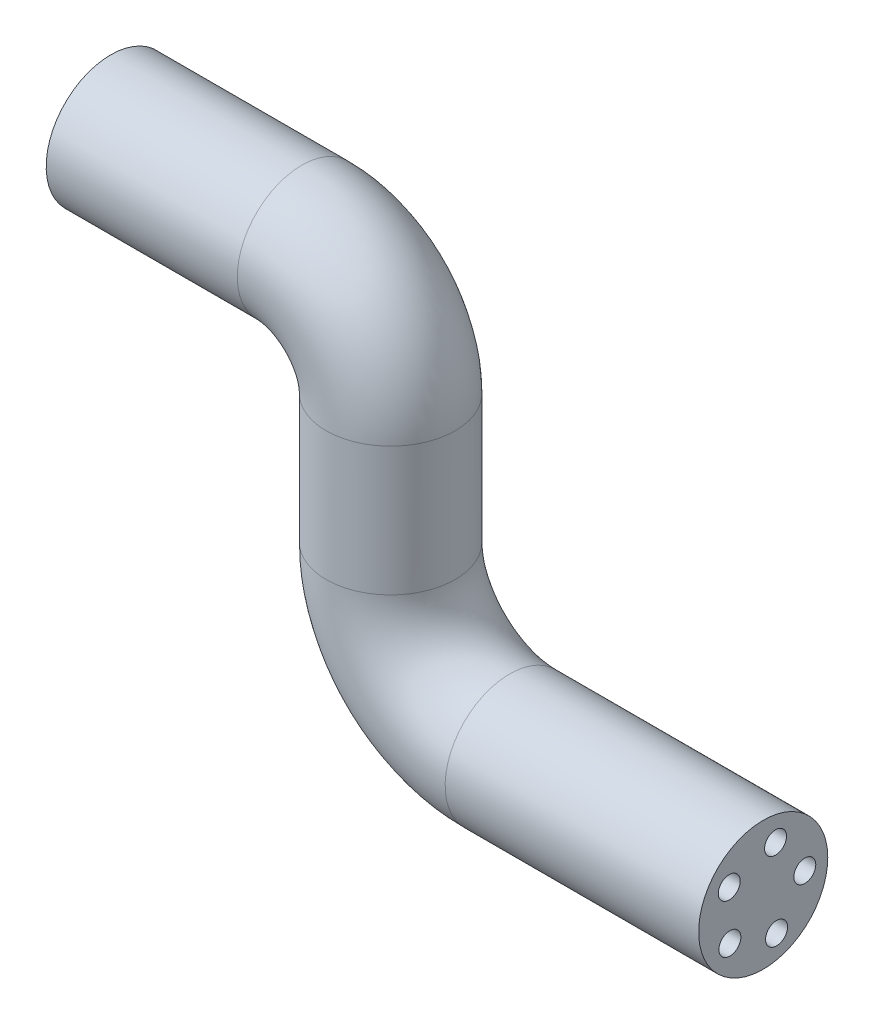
ISO-10303-21;
HEADER;
FILE_DESCRIPTION(('STEP AP214'),'2;1');
FILE_NAME('part.step','',(''),(''),'','','');
FILE_SCHEMA(('AUTOMOTIVE_DESIGN { 1 0 10303 214 1 1 1 1 }'));
ENDSEC;
DATA;
#1=APPLICATION_CONTEXT('core data for automotive mechanical design processes');
#2=APPLICATION_PROTOCOL_DEFINITION('international standard','automotive_design',2000,#1);
#3=PRODUCT_CONTEXT('',#1,'mechanical');
#4=PRODUCT('Part','Part','',(#3));
#5=PRODUCT_RELATED_PRODUCT_CATEGORY('part','',(#4));
#6=PRODUCT_DEFINITION_FORMATION('','',#4);
#7=PRODUCT_DEFINITION_CONTEXT('part definition',#1,'design');
#8=PRODUCT_DEFINITION('design','',#6,#7);
#9=PRODUCT_DEFINITION_SHAPE('','',#8);
#10=(LENGTH_UNIT() NAMED_UNIT(*) SI_UNIT(.MILLI.,.METRE.));
#11=(NAMED_UNIT(*) PLANE_ANGLE_UNIT() SI_UNIT($,.RADIAN.));
#12=(NAMED_UNIT(*) SI_UNIT($,.STERADIAN.) SOLID_ANGLE_UNIT());
#13=UNCERTAINTY_MEASURE_WITH_UNIT(LENGTH_MEASURE(1.E-05),#10,'distance_accuracy_value','');
#14=(GEOMETRIC_REPRESENTATION_CONTEXT(3) GLOBAL_UNCERTAINTY_ASSIGNED_CONTEXT((#13)) GLOBAL_UNIT_ASSIGNED_CONTEXT((#10,
#11,#12)) REPRESENTATION_CONTEXT('',''));
#15=CARTESIAN_POINT('',(0.,0.,0.));
#16=DIRECTION('',(0.,0.,1.));
#17=DIRECTION('',(1.,0.,0.));
#18=AXIS2_PLACEMENT_3D('',#15,#16,#17);
#19=CARTESIAN_POINT('',(80.2165233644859,0.219533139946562,0.));
#20=DIRECTION('',(-1.,0.,0.));
#21=DIRECTION('',(0.,0.,1.));
#22=AXIS2_PLACEMENT_3D('',#19,#20,#21);
#23=CYLINDRICAL_SURFACE('',#22,27.0969024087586);
#24=CARTESIAN_POINT('',(80.2165233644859,0.219533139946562,0.));
#25=DIRECTION('',(1.,0.,0.));
#26=DIRECTION('',(0.,0.,-1.));
#27=AXIS2_PLACEMENT_3D('',#24,#25,#26);
#28=CIRCLE('',#27,27.0969024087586);
#29=CARTESIAN_POINT('',(80.2165233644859,27.3164355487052,0.));
#30=VERTEX_POINT('',#29);
#31=EDGE_CURVE('E56',#30,#30,#28,.T.);
#32=ORIENTED_EDGE('',*,*,#31,.F.);
#33=EDGE_LOOP('',(#32));
#34=FACE_BOUND('',#33,.T.);
#35=CARTESIAN_POINT('',(0.,0.219533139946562,0.));
#36=DIRECTION('',(1.,0.,0.));
#37=DIRECTION('',(0.,0.,-1.));
#38=AXIS2_PLACEMENT_3D('',#35,#36,#37);
#39=CIRCLE('',#38,27.0969024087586);
#40=CARTESIAN_POINT('',(0.,0.219533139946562,-27.0969024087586));
#41=VERTEX_POINT('',#40);
#42=EDGE_CURVE('E10',#41,#41,#39,.T.);
#43=ORIENTED_EDGE('',*,*,#42,.T.);
#44=EDGE_LOOP('',(#43));
#45=FACE_BOUND('',#44,.T.);
#46=ADVANCED_FACE('F31',(#34,#45),#23,.T.);
#47=CARTESIAN_POINT('',(80.2165233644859,16.6695787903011,-5.18544367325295));
#48=DIRECTION('',(-1.,0.,0.));
#49=DIRECTION('',(0.,0.,1.));
#50=AXIS2_PLACEMENT_3D('',#47,#48,#49);
#51=CYLINDRICAL_SURFACE('',#50,4.60824531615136);
#52=CARTESIAN_POINT('',(80.2165233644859,16.6695787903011,-5.18544367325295));
#53=DIRECTION('',(1.,0.,0.));
#54=DIRECTION('',(0.,0.,-1.));
#55=AXIS2_PLACEMENT_3D('',#52,#53,#54);
#56=CIRCLE('',#55,4.60824531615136);
#57=CARTESIAN_POINT('',(80.2165233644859,21.2778241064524,-5.18544367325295));
#58=VERTEX_POINT('',#57);
#59=EDGE_CURVE('E59',#58,#58,#56,.T.);
#60=ORIENTED_EDGE('',*,*,#59,.T.);
#61=EDGE_LOOP('',(#60));
#62=FACE_BOUND('',#61,.T.);
#63=CARTESIAN_POINT('',(0.,16.6695787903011,-5.18544367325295));
#64=DIRECTION('',(1.,0.,0.));
#65=DIRECTION('',(0.,0.,-1.));
#66=AXIS2_PLACEMENT_3D('',#63,#64,#65);
#67=CIRCLE('',#66,4.60824531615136);
#68=CARTESIAN_POINT('',(0.,16.6695787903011,-9.79368898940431));
#69=VERTEX_POINT('',#68);
#70=EDGE_CURVE('E37',#69,#69,#67,.T.);
#71=ORIENTED_EDGE('',*,*,#70,.F.);
#72=EDGE_LOOP('',(#71));
#73=FACE_BOUND('',#72,.T.);
#74=ADVANCED_FACE('F179',(#62,#73),#51,.F.);
#75=CARTESIAN_POINT('',(80.2165233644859,10.0828331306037,14.2513213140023));
#76=DIRECTION('',(-1.,0.,0.));
#77=DIRECTION('',(0.,0.,1.));
#78=AXIS2_PLACEMENT_3D('',#75,#76,#77);
#79=CYLINDRICAL_SURFACE('',#78,4.60824531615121);
#80=CARTESIAN_POINT('',(80.2165233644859,10.0828331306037,14.2513213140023));
#81=DIRECTION('',(1.,0.,0.));
#82=DIRECTION('',(0.,0.,-1.));
#83=AXIS2_PLACEMENT_3D('',#80,#81,#82);
#84=CIRCLE('',#83,4.60824531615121);
#85=CARTESIAN_POINT('',(80.2165233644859,14.6910784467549,14.2513213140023));
#86=VERTEX_POINT('',#85);
#87=EDGE_CURVE('E62',#86,#86,#84,.T.);
#88=ORIENTED_EDGE('',*,*,#87,.T.);
#89=EDGE_LOOP('',(#88));
#90=FACE_BOUND('',#89,.T.);
#91=CARTESIAN_POINT('',(0.,10.0828331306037,14.2513213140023));
#92=DIRECTION('',(1.,0.,0.));
#93=DIRECTION('',(0.,0.,-1.));
#94=AXIS2_PLACEMENT_3D('',#91,#92,#93);
#95=CIRCLE('',#94,4.60824531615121);
#96=CARTESIAN_POINT('',(0.,10.0828331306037,9.64307599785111));
#97=VERTEX_POINT('',#96);
#98=EDGE_CURVE('E41',#97,#97,#95,.T.);
#99=ORIENTED_EDGE('',*,*,#98,.F.);
#100=EDGE_LOOP('',(#99));
#101=FACE_BOUND('',#100,.T.);
#102=ADVANCED_FACE('F184',(#90,#101),#79,.F.);
#103=CARTESIAN_POINT('',(80.2165233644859,-10.4380452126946,13.9932446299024));
#104=DIRECTION('',(-1.,0.,0.));
#105=DIRECTION('',(0.,0.,1.));
#106=AXIS2_PLACEMENT_3D('',#103,#104,#105);
#107=CYLINDRICAL_SURFACE('',#106,4.60824531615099);
#108=CARTESIAN_POINT('',(80.2165233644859,-10.4380452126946,13.9932446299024));
#109=DIRECTION('',(1.,0.,0.));
#110=DIRECTION('',(0.,0.,-1.));
#111=AXIS2_PLACEMENT_3D('',#108,#109,#110);
#112=CIRCLE('',#111,4.60824531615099);
#113=CARTESIAN_POINT('',(80.2165233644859,-5.82979989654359,13.9932446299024));
#114=VERTEX_POINT('',#113);
#115=EDGE_CURVE('E65',#114,#114,#112,.T.);
#116=ORIENTED_EDGE('',*,*,#115,.T.);
#117=EDGE_LOOP('',(#116));
#118=FACE_BOUND('',#117,.T.);
#119=CARTESIAN_POINT('',(0.,-10.4380452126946,13.9932446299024));
#120=DIRECTION('',(1.,0.,0.));
#121=DIRECTION('',(0.,0.,-1.));
#122=AXIS2_PLACEMENT_3D('',#119,#120,#121);
#123=CIRCLE('',#122,4.60824531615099);
#124=CARTESIAN_POINT('',(0.,-10.4380452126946,9.38499931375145));
#125=VERTEX_POINT('',#124);
#126=EDGE_CURVE('E45',#125,#125,#123,.T.);
#127=ORIENTED_EDGE('',*,*,#126,.F.);
#128=EDGE_LOOP('',(#127));
#129=FACE_BOUND('',#128,.T.);
#130=ADVANCED_FACE('F209',(#118,#129),#107,.F.);
#131=CARTESIAN_POINT('',(80.2165233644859,-16.5338998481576,-5.60302051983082));
#132=DIRECTION('',(-1.,0.,0.));
#133=DIRECTION('',(0.,0.,1.));
#134=AXIS2_PLACEMENT_3D('',#131,#132,#133);
#135=CYLINDRICAL_SURFACE('',#134,4.60824531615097);
#136=CARTESIAN_POINT('',(80.2165233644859,-16.5338998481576,-5.60302051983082));
#137=DIRECTION('',(1.,0.,0.));
#138=DIRECTION('',(0.,0.,-1.));
#139=AXIS2_PLACEMENT_3D('',#136,#137,#138);
#140=CIRCLE('',#139,4.60824531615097);
#141=CARTESIAN_POINT('',(80.2165233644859,-11.9256545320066,-5.60302051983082));
#142=VERTEX_POINT('',#141);
#143=EDGE_CURVE('E68',#142,#142,#140,.T.);
#144=ORIENTED_EDGE('',*,*,#143,.T.);
#145=EDGE_LOOP('',(#144));
#146=FACE_BOUND('',#145,.T.);
#147=CARTESIAN_POINT('',(0.,-16.5338998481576,-5.60302051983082));
#148=DIRECTION('',(1.,0.,0.));
#149=DIRECTION('',(0.,0.,-1.));
#150=AXIS2_PLACEMENT_3D('',#147,#148,#149);
#151=CIRCLE('',#150,4.60824531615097);
#152=CARTESIAN_POINT('',(0.,-16.5338998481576,-10.2112658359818));
#153=VERTEX_POINT('',#152);
#154=EDGE_CURVE('E50',#153,#153,#151,.T.);
#155=ORIENTED_EDGE('',*,*,#154,.F.);
#156=EDGE_LOOP('',(#155));
#157=FACE_BOUND('',#156,.T.);
#158=ADVANCED_FACE('F201',(#146,#157),#135,.F.);
#159=CARTESIAN_POINT('',(80.2165233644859,0.219533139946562,-17.456101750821));
#160=DIRECTION('',(-1.,0.,0.));
#161=DIRECTION('',(0.,0.,1.));
#162=AXIS2_PLACEMENT_3D('',#159,#160,#161);
#163=CYLINDRICAL_SURFACE('',#162,4.60824531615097);
#164=CARTESIAN_POINT('',(80.2165233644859,0.219533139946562,-17.456101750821));
#165=DIRECTION('',(1.,0.,0.));
#166=DIRECTION('',(0.,0.,-1.));
#167=AXIS2_PLACEMENT_3D('',#164,#165,#166);
#168=CIRCLE('',#167,4.60824531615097);
#169=CARTESIAN_POINT('',(80.2165233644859,4.82777845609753,-17.456101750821));
#170=VERTEX_POINT('',#169);
#171=EDGE_CURVE('E71',#170,#170,#168,.T.);
#172=ORIENTED_EDGE('',*,*,#171,.T.);
#173=EDGE_LOOP('',(#172));
#174=FACE_BOUND('',#173,.T.);
#175=CARTESIAN_POINT('',(0.,0.219533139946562,-17.456101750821));
#176=DIRECTION('',(1.,0.,0.));
#177=DIRECTION('',(0.,0.,-1.));
#178=AXIS2_PLACEMENT_3D('',#175,#176,#177);
#179=CIRCLE('',#178,4.60824531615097);
#180=CARTESIAN_POINT('',(0.,0.219533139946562,-22.0643470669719));
#181=VERTEX_POINT('',#180);
#182=EDGE_CURVE('E53',#181,#181,#179,.T.);
#183=ORIENTED_EDGE('',*,*,#182,.F.);
#184=EDGE_LOOP('',(#183));
#185=FACE_BOUND('',#184,.T.);
#186=ADVANCED_FACE('F191',(#174,#185),#163,.F.);
#187=CARTESIAN_POINT('',(80.216523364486,-37.0587921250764,0.));
#188=DIRECTION('',(0.,0.,1.));
#189=DIRECTION('',(1.,0.,0.));
#190=AXIS2_PLACEMENT_3D('',#187,#188,#189);
#191=TOROIDAL_SURFACE('',#190,37.2783252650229,27.0969024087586);
#192=CARTESIAN_POINT('',(117.494848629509,-37.0587921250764,0.));
#193=DIRECTION('',(0.,-1.,0.));
#194=DIRECTION('',(0.,0.,-1.));
#195=AXIS2_PLACEMENT_3D('',#192,#193,#194);
#196=CIRCLE('',#195,27.0969024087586);
#197=CARTESIAN_POINT('',(144.591751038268,-37.0587921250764,0.));
#198=VERTEX_POINT('',#197);
#199=EDGE_CURVE('E74',#198,#198,#196,.T.);
#200=CARTESIAN_POINT('',(80.216523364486,-37.0587921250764,0.));
#201=DIRECTION('',(0.,0.,1.));
#202=DIRECTION('',(1.,0.,0.));
#203=AXIS2_PLACEMENT_3D('',#200,#201,#202);
#204=CIRCLE('',#203,64.3752276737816);
#205=EDGE_CURVE('',#198,#30,#204,.T.);
#206=ORIENTED_EDGE('',*,*,#199,.F.);
#207=ORIENTED_EDGE('',*,*,#31,.T.);
#208=ORIENTED_EDGE('',*,*,#205,.T.);
#209=ORIENTED_EDGE('',*,*,#205,.F.);
#210=EDGE_LOOP('',(#206,#208,#207,#209));
#211=FACE_BOUND('',#210,.T.);
#212=ADVANCED_FACE('F188',(#211),#191,.T.);
#213=CARTESIAN_POINT('',(80.216523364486,-37.0587921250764,-5.18544367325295));
#214=DIRECTION('',(0.,0.,1.));
#215=DIRECTION('',(1.,0.,0.));
#216=AXIS2_PLACEMENT_3D('',#213,#214,#215);
#217=TOROIDAL_SURFACE('',#216,53.7283709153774,4.60824531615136);
#218=CARTESIAN_POINT('',(133.944894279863,-37.0587921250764,-5.18544367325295));
#219=DIRECTION('',(0.,-1.,0.));
#220=DIRECTION('',(0.,0.,-1.));
#221=AXIS2_PLACEMENT_3D('',#218,#219,#220);
#222=CIRCLE('',#221,4.60824531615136);
#223=CARTESIAN_POINT('',(138.553139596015,-37.0587921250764,-5.18544367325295));
#224=VERTEX_POINT('',#223);
#225=EDGE_CURVE('E77',#224,#224,#222,.T.);
#226=CARTESIAN_POINT('',(80.216523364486,-37.0587921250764,-5.18544367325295));
#227=DIRECTION('',(0.,0.,1.));
#228=DIRECTION('',(1.,0.,0.));
#229=AXIS2_PLACEMENT_3D('',#226,#227,#228);
#230=CIRCLE('',#229,58.3366162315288);
#231=EDGE_CURVE('',#224,#58,#230,.T.);
#232=ORIENTED_EDGE('',*,*,#225,.T.);
#233=ORIENTED_EDGE('',*,*,#59,.F.);
#234=ORIENTED_EDGE('',*,*,#231,.T.);
#235=ORIENTED_EDGE('',*,*,#231,.F.);
#236=EDGE_LOOP('',(#232,#234,#233,#235));
#237=FACE_BOUND('',#236,.T.);
#238=ADVANCED_FACE('F190',(#237),#217,.F.);
#239=CARTESIAN_POINT('',(80.216523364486,-37.0587921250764,14.2513213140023));
#240=DIRECTION('',(0.,0.,1.));
#241=DIRECTION('',(1.,0.,0.));
#242=AXIS2_PLACEMENT_3D('',#239,#240,#241);
#243=TOROIDAL_SURFACE('',#242,47.1416252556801,4.60824531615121);
#244=CARTESIAN_POINT('',(127.358148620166,-37.0587921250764,14.2513213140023));
#245=DIRECTION('',(0.,-1.,0.));
#246=DIRECTION('',(0.,0.,-1.));
#247=AXIS2_PLACEMENT_3D('',#244,#245,#246);
#248=CIRCLE('',#247,4.60824531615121);
#249=CARTESIAN_POINT('',(131.966393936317,-37.0587921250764,14.2513213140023));
#250=VERTEX_POINT('',#249);
#251=EDGE_CURVE('E80',#250,#250,#248,.T.);
#252=CARTESIAN_POINT('',(80.216523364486,-37.0587921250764,14.2513213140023));
#253=DIRECTION('',(0.,0.,1.));
#254=DIRECTION('',(1.,0.,0.));
#255=AXIS2_PLACEMENT_3D('',#252,#253,#254);
#256=CIRCLE('',#255,51.7498705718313);
#257=EDGE_CURVE('',#250,#86,#256,.T.);
#258=ORIENTED_EDGE('',*,*,#251,.T.);
#259=ORIENTED_EDGE('',*,*,#87,.F.);
#260=ORIENTED_EDGE('',*,*,#257,.T.);
#261=ORIENTED_EDGE('',*,*,#257,.F.);
#262=EDGE_LOOP('',(#258,#260,#259,#261));
#263=FACE_BOUND('',#262,.T.);
#264=ADVANCED_FACE('F198',(#263),#243,.F.);
#265=CARTESIAN_POINT('',(80.216523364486,-37.0587921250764,13.9932446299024));
#266=DIRECTION('',(0.,0.,1.));
#267=DIRECTION('',(1.,0.,0.));
#268=AXIS2_PLACEMENT_3D('',#265,#266,#267);
#269=TOROIDAL_SURFACE('',#268,26.6207469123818,4.60824531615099);
#270=CARTESIAN_POINT('',(106.837270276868,-37.0587921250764,13.9932446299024));
#271=DIRECTION('',(0.,-1.,0.));
#272=DIRECTION('',(0.,0.,-1.));
#273=AXIS2_PLACEMENT_3D('',#270,#271,#272);
#274=CIRCLE('',#273,4.60824531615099);
#275=CARTESIAN_POINT('',(111.445515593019,-37.0587921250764,13.9932446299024));
#276=VERTEX_POINT('',#275);
#277=EDGE_CURVE('E83',#276,#276,#274,.T.);
#278=CARTESIAN_POINT('',(80.216523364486,-37.0587921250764,13.9932446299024));
#279=DIRECTION('',(0.,0.,1.));
#280=DIRECTION('',(1.,0.,0.));
#281=AXIS2_PLACEMENT_3D('',#278,#279,#280);
#282=CIRCLE('',#281,31.2289922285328);
#283=EDGE_CURVE('',#276,#114,#282,.T.);
#284=ORIENTED_EDGE('',*,*,#277,.T.);
#285=ORIENTED_EDGE('',*,*,#115,.F.);
#286=ORIENTED_EDGE('',*,*,#283,.T.);
#287=ORIENTED_EDGE('',*,*,#283,.F.);
#288=EDGE_LOOP('',(#284,#286,#285,#287));
#289=FACE_BOUND('',#288,.T.);
#290=ADVANCED_FACE('F225',(#289),#269,.F.);
#291=CARTESIAN_POINT('',(80.216523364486,-37.0587921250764,-5.60302051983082));
#292=DIRECTION('',(0.,0.,1.));
#293=DIRECTION('',(1.,0.,0.));
#294=AXIS2_PLACEMENT_3D('',#291,#292,#293);
#295=TOROIDAL_SURFACE('',#294,20.5248922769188,4.60824531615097);
#296=CARTESIAN_POINT('',(100.741415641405,-37.0587921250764,-5.60302051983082));
#297=DIRECTION('',(0.,-1.,0.));
#298=DIRECTION('',(0.,0.,-1.));
#299=AXIS2_PLACEMENT_3D('',#296,#297,#298);
#300=CIRCLE('',#299,4.60824531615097);
#301=CARTESIAN_POINT('',(105.349660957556,-37.0587921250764,-5.60302051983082));
#302=VERTEX_POINT('',#301);
#303=EDGE_CURVE('E86',#302,#302,#300,.T.);
#304=CARTESIAN_POINT('',(80.216523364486,-37.0587921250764,-5.60302051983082));
#305=DIRECTION('',(0.,0.,1.));
#306=DIRECTION('',(1.,0.,0.));
#307=AXIS2_PLACEMENT_3D('',#304,#305,#306);
#308=CIRCLE('',#307,25.1331375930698);
#309=EDGE_CURVE('',#302,#142,#308,.T.);
#310=ORIENTED_EDGE('',*,*,#303,.T.);
#311=ORIENTED_EDGE('',*,*,#143,.F.);
#312=ORIENTED_EDGE('',*,*,#309,.T.);
#313=ORIENTED_EDGE('',*,*,#309,.F.);
#314=EDGE_LOOP('',(#310,#312,#311,#313));
#315=FACE_BOUND('',#314,.T.);
#316=ADVANCED_FACE('F230',(#315),#295,.F.);
#317=CARTESIAN_POINT('',(80.216523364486,-37.0587921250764,-17.456101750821));
#318=DIRECTION('',(0.,0.,1.));
#319=DIRECTION('',(1.,0.,0.));
#320=AXIS2_PLACEMENT_3D('',#317,#318,#319);
#321=TOROIDAL_SURFACE('',#320,37.2783252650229,4.60824531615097);
#322=CARTESIAN_POINT('',(117.494848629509,-37.0587921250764,-17.456101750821));
#323=DIRECTION('',(0.,-1.,0.));
#324=DIRECTION('',(0.,0.,-1.));
#325=AXIS2_PLACEMENT_3D('',#322,#323,#324);
#326=CIRCLE('',#325,4.60824531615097);
#327=CARTESIAN_POINT('',(122.10309394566,-37.0587921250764,-17.456101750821));
#328=VERTEX_POINT('',#327);
#329=EDGE_CURVE('E89',#328,#328,#326,.T.);
#330=CARTESIAN_POINT('',(80.216523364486,-37.0587921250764,-17.456101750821));
#331=DIRECTION('',(0.,0.,1.));
#332=DIRECTION('',(1.,0.,0.));
#333=AXIS2_PLACEMENT_3D('',#330,#331,#332);
#334=CIRCLE('',#333,41.8865705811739);
#335=EDGE_CURVE('',#328,#170,#334,.T.);
#336=ORIENTED_EDGE('',*,*,#329,.T.);
#337=ORIENTED_EDGE('',*,*,#171,.F.);
#338=ORIENTED_EDGE('',*,*,#335,.T.);
#339=ORIENTED_EDGE('',*,*,#335,.F.);
#340=EDGE_LOOP('',(#336,#338,#337,#339));
#341=FACE_BOUND('',#340,.T.);
#342=ADVANCED_FACE('F236',(#341),#321,.F.);
#343=CARTESIAN_POINT('',(117.494848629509,-91.1353064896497,0.));
#344=DIRECTION('',(0.,1.,0.));
#345=DIRECTION('',(0.,0.,1.));
#346=AXIS2_PLACEMENT_3D('',#343,#344,#345);
#347=CYLINDRICAL_SURFACE('',#346,27.0969024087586);
#348=CARTESIAN_POINT('',(117.494848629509,-91.1353064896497,0.));
#349=DIRECTION('',(0.,-1.,0.));
#350=DIRECTION('',(0.,0.,-1.));
#351=AXIS2_PLACEMENT_3D('',#348,#349,#350);
#352=CIRCLE('',#351,27.0969024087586);
#353=CARTESIAN_POINT('',(90.3979462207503,-91.1353064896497,0.));
#354=VERTEX_POINT('',#353);
#355=EDGE_CURVE('E92',#354,#354,#352,.T.);
#356=ORIENTED_EDGE('',*,*,#355,.F.);
#357=EDGE_LOOP('',(#356));
#358=FACE_BOUND('',#357,.T.);
#359=ORIENTED_EDGE('',*,*,#199,.T.);
#360=EDGE_LOOP('',(#359));
#361=FACE_BOUND('',#360,.T.);
#362=ADVANCED_FACE('F240',(#358,#361),#347,.T.);
#363=CARTESIAN_POINT('',(133.944894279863,-91.1353064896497,-5.18544367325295));
#364=DIRECTION('',(0.,1.,0.));
#365=DIRECTION('',(0.,0.,1.));
#366=AXIS2_PLACEMENT_3D('',#363,#364,#365);
#367=CYLINDRICAL_SURFACE('',#366,4.60824531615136);
#368=CARTESIAN_POINT('',(133.944894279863,-91.1353064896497,-5.18544367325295));
#369=DIRECTION('',(0.,-1.,0.));
#370=DIRECTION('',(0.,0.,-1.));
#371=AXIS2_PLACEMENT_3D('',#368,#369,#370);
#372=CIRCLE('',#371,4.60824531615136);
#373=CARTESIAN_POINT('',(129.336648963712,-91.1353064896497,-5.18544367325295));
#374=VERTEX_POINT('',#373);
#375=EDGE_CURVE('E95',#374,#374,#372,.T.);
#376=ORIENTED_EDGE('',*,*,#375,.T.);
#377=EDGE_LOOP('',(#376));
#378=FACE_BOUND('',#377,.T.);
#379=ORIENTED_EDGE('',*,*,#225,.F.);
#380=EDGE_LOOP('',(#379));
#381=FACE_BOUND('',#380,.T.);
#382=ADVANCED_FACE('F244',(#378,#381),#367,.F.);
#383=CARTESIAN_POINT('',(127.358148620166,-91.1353064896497,14.2513213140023));
#384=DIRECTION('',(0.,1.,0.));
#385=DIRECTION('',(0.,0.,1.));
#386=AXIS2_PLACEMENT_3D('',#383,#384,#385);
#387=CYLINDRICAL_SURFACE('',#386,4.60824531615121);
#388=CARTESIAN_POINT('',(127.358148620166,-91.1353064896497,14.2513213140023));
#389=DIRECTION('',(0.,-1.,0.));
#390=DIRECTION('',(0.,0.,-1.));
#391=AXIS2_PLACEMENT_3D('',#388,#389,#390);
#392=CIRCLE('',#391,4.60824531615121);
#393=CARTESIAN_POINT('',(122.749903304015,-91.1353064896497,14.2513213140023));
#394=VERTEX_POINT('',#393);
#395=EDGE_CURVE('E98',#394,#394,#392,.T.);
#396=ORIENTED_EDGE('',*,*,#395,.T.);
#397=EDGE_LOOP('',(#396));
#398=FACE_BOUND('',#397,.T.);
#399=ORIENTED_EDGE('',*,*,#251,.F.);
#400=EDGE_LOOP('',(#399));
#401=FACE_BOUND('',#400,.T.);
#402=ADVANCED_FACE('F248',(#398,#401),#387,.F.);
#403=CARTESIAN_POINT('',(106.837270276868,-91.1353064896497,13.9932446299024));
#404=DIRECTION('',(0.,1.,0.));
#405=DIRECTION('',(0.,0.,1.));
#406=AXIS2_PLACEMENT_3D('',#403,#404,#405);
#407=CYLINDRICAL_SURFACE('',#406,4.60824531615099);
#408=CARTESIAN_POINT('',(106.837270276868,-91.1353064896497,13.9932446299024));
#409=DIRECTION('',(0.,-1.,0.));
#410=DIRECTION('',(0.,0.,-1.));
#411=AXIS2_PLACEMENT_3D('',#408,#409,#410);
#412=CIRCLE('',#411,4.60824531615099);
#413=CARTESIAN_POINT('',(102.229024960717,-91.1353064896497,13.9932446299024));
#414=VERTEX_POINT('',#413);
#415=EDGE_CURVE('E101',#414,#414,#412,.T.);
#416=ORIENTED_EDGE('',*,*,#415,.T.);
#417=EDGE_LOOP('',(#416));
#418=FACE_BOUND('',#417,.T.);
#419=ORIENTED_EDGE('',*,*,#277,.F.);
#420=EDGE_LOOP('',(#419));
#421=FACE_BOUND('',#420,.T.);
#422=ADVANCED_FACE('F252',(#418,#421),#407,.F.);
#423=CARTESIAN_POINT('',(100.741415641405,-91.1353064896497,-5.60302051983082));
#424=DIRECTION('',(0.,1.,0.));
#425=DIRECTION('',(0.,0.,1.));
#426=AXIS2_PLACEMENT_3D('',#423,#424,#425);
#427=CYLINDRICAL_SURFACE('',#426,4.60824531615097);
#428=CARTESIAN_POINT('',(100.741415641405,-91.1353064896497,-5.60302051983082));
#429=DIRECTION('',(0.,-1.,0.));
#430=DIRECTION('',(0.,0.,-1.));
#431=AXIS2_PLACEMENT_3D('',#428,#429,#430);
#432=CIRCLE('',#431,4.60824531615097);
#433=CARTESIAN_POINT('',(96.1331703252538,-91.1353064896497,-5.60302051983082));
#434=VERTEX_POINT('',#433);
#435=EDGE_CURVE('E104',#434,#434,#432,.T.);
#436=ORIENTED_EDGE('',*,*,#435,.T.);
#437=EDGE_LOOP('',(#436));
#438=FACE_BOUND('',#437,.T.);
#439=ORIENTED_EDGE('',*,*,#303,.F.);
#440=EDGE_LOOP('',(#439));
#441=FACE_BOUND('',#440,.T.);
#442=ADVANCED_FACE('F256',(#438,#441),#427,.F.);
#443=CARTESIAN_POINT('',(117.494848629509,-91.1353064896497,-17.456101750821));
#444=DIRECTION('',(0.,1.,0.));
#445=DIRECTION('',(0.,0.,1.));
#446=AXIS2_PLACEMENT_3D('',#443,#444,#445);
#447=CYLINDRICAL_SURFACE('',#446,4.60824531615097);
#448=CARTESIAN_POINT('',(117.494848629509,-91.1353064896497,-17.456101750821));
#449=DIRECTION('',(0.,-1.,0.));
#450=DIRECTION('',(0.,0.,-1.));
#451=AXIS2_PLACEMENT_3D('',#448,#449,#450);
#452=CIRCLE('',#451,4.60824531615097);
#453=CARTESIAN_POINT('',(112.886603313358,-91.1353064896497,-17.456101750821));
#454=VERTEX_POINT('',#453);
#455=EDGE_CURVE('E107',#454,#454,#452,.T.);
#456=ORIENTED_EDGE('',*,*,#455,.T.);
#457=EDGE_LOOP('',(#456));
#458=FACE_BOUND('',#457,.T.);
#459=ORIENTED_EDGE('',*,*,#329,.F.);
#460=EDGE_LOOP('',(#459));
#461=FACE_BOUND('',#460,.T.);
#462=ADVANCED_FACE('F260',(#458,#461),#447,.F.);
#463=CARTESIAN_POINT('',(167.458962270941,-91.1353064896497,0.));
#464=DIRECTION('',(0.,0.,-1.));
#465=DIRECTION('',(-1.,0.,0.));
#466=AXIS2_PLACEMENT_3D('',#463,#464,#465);
#467=TOROIDAL_SURFACE('',#466,49.9641136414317,27.0969024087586);
#468=CARTESIAN_POINT('',(167.458962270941,-141.099420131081,0.));
#469=DIRECTION('',(1.,0.,0.));
#470=DIRECTION('',(0.,0.,-1.));
#471=AXIS2_PLACEMENT_3D('',#468,#469,#470);
#472=CIRCLE('',#471,27.0969024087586);
#473=CARTESIAN_POINT('',(167.458962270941,-168.19632253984,0.));
#474=VERTEX_POINT('',#473);
#475=EDGE_CURVE('E110',#474,#474,#472,.T.);
#476=CARTESIAN_POINT('',(167.458962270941,-91.1353064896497,0.));
#477=DIRECTION('',(0.,0.,-1.));
#478=DIRECTION('',(-1.,0.,0.));
#479=AXIS2_PLACEMENT_3D('',#476,#477,#478);
#480=CIRCLE('',#479,77.0610160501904);
#481=EDGE_CURVE('',#474,#354,#480,.T.);
#482=ORIENTED_EDGE('',*,*,#475,.F.);
#483=ORIENTED_EDGE('',*,*,#355,.T.);
#484=ORIENTED_EDGE('',*,*,#481,.T.);
#485=ORIENTED_EDGE('',*,*,#481,.F.);
#486=EDGE_LOOP('',(#482,#484,#483,#485));
#487=FACE_BOUND('',#486,.T.);
#488=ADVANCED_FACE('F264',(#487),#467,.T.);
#489=CARTESIAN_POINT('',(167.458962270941,-91.1353064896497,-5.18544367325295));
#490=DIRECTION('',(0.,0.,-1.));
#491=DIRECTION('',(-1.,0.,0.));
#492=AXIS2_PLACEMENT_3D('',#489,#490,#491);
#493=TOROIDAL_SURFACE('',#492,33.5140679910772,4.60824531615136);
#494=CARTESIAN_POINT('',(167.458962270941,-124.649374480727,-5.18544367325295));
#495=DIRECTION('',(1.,0.,0.));
#496=DIRECTION('',(0.,0.,-1.));
#497=AXIS2_PLACEMENT_3D('',#494,#495,#496);
#498=CIRCLE('',#497,4.60824531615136);
#499=CARTESIAN_POINT('',(167.458962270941,-129.257619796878,-5.18544367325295));
#500=VERTEX_POINT('',#499);
#501=EDGE_CURVE('E113',#500,#500,#498,.T.);
#502=CARTESIAN_POINT('',(167.458962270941,-91.1353064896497,-5.18544367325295));
#503=DIRECTION('',(0.,0.,-1.));
#504=DIRECTION('',(-1.,0.,0.));
#505=AXIS2_PLACEMENT_3D('',#502,#503,#504);
#506=CIRCLE('',#505,38.1223133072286);
#507=EDGE_CURVE('',#500,#374,#506,.T.);
#508=ORIENTED_EDGE('',*,*,#501,.T.);
#509=ORIENTED_EDGE('',*,*,#375,.F.);
#510=ORIENTED_EDGE('',*,*,#507,.T.);
#511=ORIENTED_EDGE('',*,*,#507,.F.);
#512=EDGE_LOOP('',(#508,#510,#509,#511));
#513=FACE_BOUND('',#512,.T.);
#514=ADVANCED_FACE('F268',(#513),#493,.F.);
#515=CARTESIAN_POINT('',(167.458962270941,-91.1353064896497,14.2513213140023));
#516=DIRECTION('',(0.,0.,-1.));
#517=DIRECTION('',(-1.,0.,0.));
#518=AXIS2_PLACEMENT_3D('',#515,#516,#517);
#519=TOROIDAL_SURFACE('',#518,40.1008136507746,4.60824531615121);
#520=CARTESIAN_POINT('',(167.458962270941,-131.236120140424,14.2513213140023));
#521=DIRECTION('',(1.,0.,0.));
#522=DIRECTION('',(0.,0.,-1.));
#523=AXIS2_PLACEMENT_3D('',#520,#521,#522);
#524=CIRCLE('',#523,4.60824531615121);
#525=CARTESIAN_POINT('',(167.458962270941,-135.844365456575,14.2513213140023));
#526=VERTEX_POINT('',#525);
#527=EDGE_CURVE('E116',#526,#526,#524,.T.);
#528=CARTESIAN_POINT('',(167.458962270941,-91.1353064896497,14.2513213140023));
#529=DIRECTION('',(0.,0.,-1.));
#530=DIRECTION('',(-1.,0.,0.));
#531=AXIS2_PLACEMENT_3D('',#528,#529,#530);
#532=CIRCLE('',#531,44.7090589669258);
#533=EDGE_CURVE('',#526,#394,#532,.T.);
#534=ORIENTED_EDGE('',*,*,#527,.T.);
#535=ORIENTED_EDGE('',*,*,#395,.F.);
#536=ORIENTED_EDGE('',*,*,#533,.T.);
#537=ORIENTED_EDGE('',*,*,#533,.F.);
#538=EDGE_LOOP('',(#534,#536,#535,#537));
#539=FACE_BOUND('',#538,.T.);
#540=ADVANCED_FACE('F272',(#539),#519,.F.);
#541=CARTESIAN_POINT('',(167.458962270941,-91.1353064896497,13.9932446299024));
#542=DIRECTION('',(0.,0.,-1.));
#543=DIRECTION('',(-1.,0.,0.));
#544=AXIS2_PLACEMENT_3D('',#541,#542,#543);
#545=TOROIDAL_SURFACE('',#544,60.6216919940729,4.60824531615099);
#546=CARTESIAN_POINT('',(167.458962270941,-151.756998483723,13.9932446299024));
#547=DIRECTION('',(1.,0.,0.));
#548=DIRECTION('',(0.,0.,-1.));
#549=AXIS2_PLACEMENT_3D('',#546,#547,#548);
#550=CIRCLE('',#549,4.60824531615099);
#551=CARTESIAN_POINT('',(167.458962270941,-156.365243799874,13.9932446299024));
#552=VERTEX_POINT('',#551);
#553=EDGE_CURVE('E119',#552,#552,#550,.T.);
#554=CARTESIAN_POINT('',(167.458962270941,-91.1353064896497,13.9932446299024));
#555=DIRECTION('',(0.,0.,-1.));
#556=DIRECTION('',(-1.,0.,0.));
#557=AXIS2_PLACEMENT_3D('',#554,#555,#556);
#558=CIRCLE('',#557,65.2299373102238);
#559=EDGE_CURVE('',#552,#414,#558,.T.);
#560=ORIENTED_EDGE('',*,*,#553,.T.);
#561=ORIENTED_EDGE('',*,*,#415,.F.);
#562=ORIENTED_EDGE('',*,*,#559,.T.);
#563=ORIENTED_EDGE('',*,*,#559,.F.);
#564=EDGE_LOOP('',(#560,#562,#561,#563));
#565=FACE_BOUND('',#564,.T.);
#566=ADVANCED_FACE('F276',(#565),#545,.F.);
#567=CARTESIAN_POINT('',(167.458962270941,-91.1353064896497,-5.60302051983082));
#568=DIRECTION('',(0.,0.,-1.));
#569=DIRECTION('',(-1.,0.,0.));
#570=AXIS2_PLACEMENT_3D('',#567,#568,#569);
#571=TOROIDAL_SURFACE('',#570,66.7175466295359,4.60824531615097);
#572=CARTESIAN_POINT('',(167.458962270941,-157.852853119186,-5.60302051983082));
#573=DIRECTION('',(1.,0.,0.));
#574=DIRECTION('',(0.,0.,-1.));
#575=AXIS2_PLACEMENT_3D('',#572,#573,#574);
#576=CIRCLE('',#575,4.60824531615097);
#577=CARTESIAN_POINT('',(167.458962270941,-162.461098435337,-5.60302051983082));
#578=VERTEX_POINT('',#577);
#579=EDGE_CURVE('E122',#578,#578,#576,.T.);
#580=CARTESIAN_POINT('',(167.458962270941,-91.1353064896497,-5.60302051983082));
#581=DIRECTION('',(0.,0.,-1.));
#582=DIRECTION('',(-1.,0.,0.));
#583=AXIS2_PLACEMENT_3D('',#580,#581,#582);
#584=CIRCLE('',#583,71.3257919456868);
#585=EDGE_CURVE('',#578,#434,#584,.T.);
#586=ORIENTED_EDGE('',*,*,#579,.T.);
#587=ORIENTED_EDGE('',*,*,#435,.F.);
#588=ORIENTED_EDGE('',*,*,#585,.T.);
#589=ORIENTED_EDGE('',*,*,#585,.F.);
#590=EDGE_LOOP('',(#586,#588,#587,#589));
#591=FACE_BOUND('',#590,.T.);
#592=ADVANCED_FACE('F280',(#591),#571,.F.);
#593=CARTESIAN_POINT('',(167.458962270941,-91.1353064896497,-17.456101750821));
#594=DIRECTION('',(0.,0.,-1.));
#595=DIRECTION('',(-1.,0.,0.));
#596=AXIS2_PLACEMENT_3D('',#593,#594,#595);
#597=TOROIDAL_SURFACE('',#596,49.9641136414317,4.60824531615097);
#598=CARTESIAN_POINT('',(167.458962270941,-141.099420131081,-17.456101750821));
#599=DIRECTION('',(1.,0.,0.));
#600=DIRECTION('',(0.,0.,-1.));
#601=AXIS2_PLACEMENT_3D('',#598,#599,#600);
#602=CIRCLE('',#601,4.60824531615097);
#603=CARTESIAN_POINT('',(167.458962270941,-145.707665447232,-17.456101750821));
#604=VERTEX_POINT('',#603);
#605=EDGE_CURVE('E125',#604,#604,#602,.T.);
#606=CARTESIAN_POINT('',(167.458962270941,-91.1353064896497,-17.456101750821));
#607=DIRECTION('',(0.,0.,-1.));
#608=DIRECTION('',(-1.,0.,0.));
#609=AXIS2_PLACEMENT_3D('',#606,#607,#608);
#610=CIRCLE('',#609,54.5723589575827);
#611=EDGE_CURVE('',#604,#454,#610,.T.);
#612=ORIENTED_EDGE('',*,*,#605,.T.);
#613=ORIENTED_EDGE('',*,*,#455,.F.);
#614=ORIENTED_EDGE('',*,*,#611,.T.);
#615=ORIENTED_EDGE('',*,*,#611,.F.);
#616=EDGE_LOOP('',(#612,#614,#613,#615));
#617=FACE_BOUND('',#616,.T.);
#618=ADVANCED_FACE('F284',(#617),#597,.F.);
#619=CARTESIAN_POINT('',(167.458962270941,-124.649374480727,-5.18544367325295));
#620=DIRECTION('',(1.,0.,0.));
#621=DIRECTION('',(0.,0.,-1.));
#622=AXIS2_PLACEMENT_3D('',#619,#620,#621);
#623=CYLINDRICAL_SURFACE('',#622,4.60824531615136);
#624=ORIENTED_EDGE('',*,*,#501,.F.);
#625=EDGE_LOOP('',(#624));
#626=FACE_BOUND('',#625,.T.);
#627=CARTESIAN_POINT('',(273.864224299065,-124.649374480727,-5.18544367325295));
#628=DIRECTION('',(1.,0.,0.));
#629=DIRECTION('',(0.,0.,-1.));
#630=AXIS2_PLACEMENT_3D('',#627,#628,#629);
#631=CIRCLE('',#630,4.60824531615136);
#632=CARTESIAN_POINT('',(273.864224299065,-124.649374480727,-9.79368898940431));
#633=VERTEX_POINT('',#632);
#634=EDGE_CURVE('E131',#633,#633,#631,.T.);
#635=ORIENTED_EDGE('',*,*,#634,.T.);
#636=EDGE_LOOP('',(#635));
#637=FACE_BOUND('',#636,.T.);
#638=ADVANCED_FACE('F287',(#626,#637),#623,.F.);
#639=CARTESIAN_POINT('',(167.458962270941,-131.236120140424,14.2513213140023));
#640=DIRECTION('',(1.,0.,0.));
#641=DIRECTION('',(0.,0.,-1.));
#642=AXIS2_PLACEMENT_3D('',#639,#640,#641);
#643=CYLINDRICAL_SURFACE('',#642,4.60824531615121);
#644=ORIENTED_EDGE('',*,*,#527,.F.);
#645=EDGE_LOOP('',(#644));
#646=FACE_BOUND('',#645,.T.);
#647=CARTESIAN_POINT('',(273.864224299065,-131.236120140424,14.2513213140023));
#648=DIRECTION('',(1.,0.,0.));
#649=DIRECTION('',(0.,0.,-1.));
#650=AXIS2_PLACEMENT_3D('',#647,#648,#649);
#651=CIRCLE('',#650,4.60824531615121);
#652=CARTESIAN_POINT('',(273.864224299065,-131.236120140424,9.64307599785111));
#653=VERTEX_POINT('',#652);
#654=EDGE_CURVE('E134',#653,#653,#651,.T.);
#655=ORIENTED_EDGE('',*,*,#654,.T.);
#656=EDGE_LOOP('',(#655));
#657=FACE_BOUND('',#656,.T.);
#658=ADVANCED_FACE('F296',(#646,#657),#643,.F.);
#659=CARTESIAN_POINT('',(167.458962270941,-151.756998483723,13.9932446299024));
#660=DIRECTION('',(1.,0.,0.));
#661=DIRECTION('',(0.,0.,-1.));
#662=AXIS2_PLACEMENT_3D('',#659,#660,#661);
#663=CYLINDRICAL_SURFACE('',#662,4.60824531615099);
#664=ORIENTED_EDGE('',*,*,#553,.F.);
#665=EDGE_LOOP('',(#664));
#666=FACE_BOUND('',#665,.T.);
#667=CARTESIAN_POINT('',(273.864224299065,-151.756998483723,13.9932446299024));
#668=DIRECTION('',(1.,0.,0.));
#669=DIRECTION('',(0.,0.,-1.));
#670=AXIS2_PLACEMENT_3D('',#667,#668,#669);
#671=CIRCLE('',#670,4.60824531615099);
#672=CARTESIAN_POINT('',(273.864224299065,-151.756998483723,9.38499931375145));
#673=VERTEX_POINT('',#672);
#674=EDGE_CURVE('E137',#673,#673,#671,.T.);
#675=ORIENTED_EDGE('',*,*,#674,.T.);
#676=EDGE_LOOP('',(#675));
#677=FACE_BOUND('',#676,.T.);
#678=ADVANCED_FACE('F292',(#666,#677),#663,.F.);
#679=CARTESIAN_POINT('',(167.458962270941,-157.852853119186,-5.60302051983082));
#680=DIRECTION('',(1.,0.,0.));
#681=DIRECTION('',(0.,0.,-1.));
#682=AXIS2_PLACEMENT_3D('',#679,#680,#681);
#683=CYLINDRICAL_SURFACE('',#682,4.60824531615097);
#684=ORIENTED_EDGE('',*,*,#579,.F.);
#685=EDGE_LOOP('',(#684));
#686=FACE_BOUND('',#685,.T.);
#687=CARTESIAN_POINT('',(273.864224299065,-157.852853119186,-5.60302051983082));
#688=DIRECTION('',(1.,0.,0.));
#689=DIRECTION('',(0.,0.,-1.));
#690=AXIS2_PLACEMENT_3D('',#687,#688,#689);
#691=CIRCLE('',#690,4.60824531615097);
#692=CARTESIAN_POINT('',(273.864224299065,-157.852853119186,-10.2112658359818));
#693=VERTEX_POINT('',#692);
#694=EDGE_CURVE('E140',#693,#693,#691,.T.);
#695=ORIENTED_EDGE('',*,*,#694,.T.);
#696=EDGE_LOOP('',(#695));
#697=FACE_BOUND('',#696,.T.);
#698=ADVANCED_FACE('F174',(#686,#697),#683,.F.);
#699=CARTESIAN_POINT('',(167.458962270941,-141.099420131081,-17.456101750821));
#700=DIRECTION('',(1.,0.,0.));
#701=DIRECTION('',(0.,0.,-1.));
#702=AXIS2_PLACEMENT_3D('',#699,#700,#701);
#703=CYLINDRICAL_SURFACE('',#702,4.60824531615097);
#704=ORIENTED_EDGE('',*,*,#605,.F.);
#705=EDGE_LOOP('',(#704));
#706=FACE_BOUND('',#705,.T.);
#707=CARTESIAN_POINT('',(273.864224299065,-141.099420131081,-17.456101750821));
#708=DIRECTION('',(1.,0.,0.));
#709=DIRECTION('',(0.,0.,-1.));
#710=AXIS2_PLACEMENT_3D('',#707,#708,#709);
#711=CIRCLE('',#710,4.60824531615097);
#712=CARTESIAN_POINT('',(273.864224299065,-141.099420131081,-22.0643470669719));
#713=VERTEX_POINT('',#712);
#714=EDGE_CURVE('E143',#713,#713,#711,.T.);
#715=ORIENTED_EDGE('',*,*,#714,.T.);
#716=EDGE_LOOP('',(#715));
#717=FACE_BOUND('',#716,.T.);
#718=ADVANCED_FACE('F147',(#706,#717),#703,.F.);
#719=CARTESIAN_POINT('',(167.458962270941,-141.099420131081,0.));
#720=DIRECTION('',(1.,0.,0.));
#721=DIRECTION('',(0.,0.,-1.));
#722=AXIS2_PLACEMENT_3D('',#719,#720,#721);
#723=CYLINDRICAL_SURFACE('',#722,27.0969024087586);
#724=ORIENTED_EDGE('',*,*,#475,.T.);
#725=EDGE_LOOP('',(#724));
#726=FACE_BOUND('',#725,.T.);
#727=CARTESIAN_POINT('',(273.864224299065,-141.099420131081,0.));
#728=DIRECTION('',(1.,0.,0.));
#729=DIRECTION('',(0.,0.,-1.));
#730=AXIS2_PLACEMENT_3D('',#727,#728,#729);
#731=CIRCLE('',#730,27.0969024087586);
#732=CARTESIAN_POINT('',(273.864224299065,-141.099420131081,-27.0969024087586));
#733=VERTEX_POINT('',#732);
#734=EDGE_CURVE('E128',#733,#733,#731,.T.);
#735=ORIENTED_EDGE('',*,*,#734,.F.);
#736=EDGE_LOOP('',(#735));
#737=FACE_BOUND('',#736,.T.);
#738=ADVANCED_FACE('F164',(#726,#737),#723,.T.);
#739=CARTESIAN_POINT('',(0.,0.219533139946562,0.));
#740=DIRECTION('',(1.,0.,0.));
#741=DIRECTION('',(0.,0.,-1.));
#742=AXIS2_PLACEMENT_3D('',#739,#740,#741);
#743=PLANE('',#742);
#744=ORIENTED_EDGE('',*,*,#182,.T.);
#745=EDGE_LOOP('',(#744));
#746=FACE_BOUND('',#745,.T.);
#747=ORIENTED_EDGE('',*,*,#154,.T.);
#748=EDGE_LOOP('',(#747));
#749=FACE_BOUND('',#748,.T.);
#750=ORIENTED_EDGE('',*,*,#126,.T.);
#751=EDGE_LOOP('',(#750));
#752=FACE_BOUND('',#751,.T.);
#753=ORIENTED_EDGE('',*,*,#98,.T.);
#754=EDGE_LOOP('',(#753));
#755=FACE_BOUND('',#754,.T.);
#756=ORIENTED_EDGE('',*,*,#70,.T.);
#757=EDGE_LOOP('',(#756));
#758=FACE_BOUND('',#757,.T.);
#759=ORIENTED_EDGE('',*,*,#42,.F.);
#760=EDGE_LOOP('',(#759));
#761=FACE_BOUND('',#760,.T.);
#762=ADVANCED_FACE('F152',(#746,#749,#752,#755,#758,#761),#743,.F.);
#763=CARTESIAN_POINT('',(273.864224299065,-141.099420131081,0.));
#764=DIRECTION('',(1.,0.,0.));
#765=DIRECTION('',(0.,0.,-1.));
#766=AXIS2_PLACEMENT_3D('',#763,#764,#765);
#767=PLANE('',#766);
#768=ORIENTED_EDGE('',*,*,#714,.F.);
#769=EDGE_LOOP('',(#768));
#770=FACE_BOUND('',#769,.T.);
#771=ORIENTED_EDGE('',*,*,#694,.F.);
#772=EDGE_LOOP('',(#771));
#773=FACE_BOUND('',#772,.T.);
#774=ORIENTED_EDGE('',*,*,#674,.F.);
#775=EDGE_LOOP('',(#774));
#776=FACE_BOUND('',#775,.T.);
#777=ORIENTED_EDGE('',*,*,#654,.F.);
#778=EDGE_LOOP('',(#777));
#779=FACE_BOUND('',#778,.T.);
#780=ORIENTED_EDGE('',*,*,#634,.F.);
#781=EDGE_LOOP('',(#780));
#782=FACE_BOUND('',#781,.T.);
#783=ORIENTED_EDGE('',*,*,#734,.T.);
#784=EDGE_LOOP('',(#783));
#785=FACE_BOUND('',#784,.T.);
#786=ADVANCED_FACE('F149',(#770,#773,#776,#779,#782,#785),#767,.T.);
#787=CLOSED_SHELL('',(#46,#74,#102,#130,#158,#186,#212,#238,#264,#290,#316,#342,#362,#382,#402,
#422,#442,#462,#488,#514,#540,#566,#592,#618,#638,#658,#678,#698,#718,#738,#762,#786));
#788=MANIFOLD_SOLID_BREP('B2',#787);
#789=ADVANCED_BREP_SHAPE_REPRESENTATION('',(#18,#788),#14);
#790=SHAPE_DEFINITION_REPRESENTATION(#9,#789);
ENDSEC;
END-ISO-10303-21;
